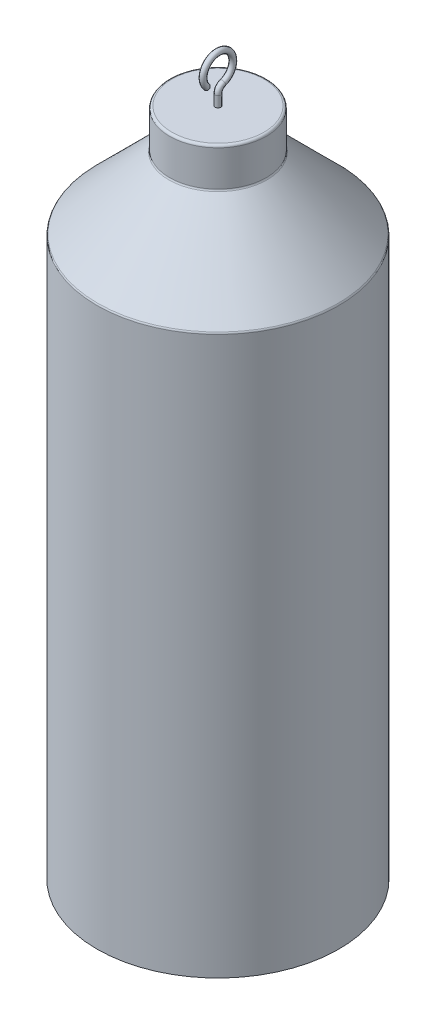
ISO-10303-21;
HEADER;
FILE_DESCRIPTION(('STEP AP214'),'2;1');
FILE_NAME('part.step','',(''),(''),'','','');
FILE_SCHEMA(('AUTOMOTIVE_DESIGN { 1 0 10303 214 1 1 1 1 }'));
ENDSEC;
DATA;
#1=APPLICATION_CONTEXT('core data for automotive mechanical design processes');
#2=APPLICATION_PROTOCOL_DEFINITION('international standard','automotive_design',2000,#1);
#3=PRODUCT_CONTEXT('',#1,'mechanical');
#4=PRODUCT('Part','Part','',(#3));
#5=PRODUCT_RELATED_PRODUCT_CATEGORY('part','',(#4));
#6=PRODUCT_DEFINITION_FORMATION('','',#4);
#7=PRODUCT_DEFINITION_CONTEXT('part definition',#1,'design');
#8=PRODUCT_DEFINITION('design','',#6,#7);
#9=PRODUCT_DEFINITION_SHAPE('','',#8);
#10=(LENGTH_UNIT() NAMED_UNIT(*) SI_UNIT(.MILLI.,.METRE.));
#11=(NAMED_UNIT(*) PLANE_ANGLE_UNIT() SI_UNIT($,.RADIAN.));
#12=(NAMED_UNIT(*) SI_UNIT($,.STERADIAN.) SOLID_ANGLE_UNIT());
#13=UNCERTAINTY_MEASURE_WITH_UNIT(LENGTH_MEASURE(1.E-05),#10,'distance_accuracy_value','');
#14=(GEOMETRIC_REPRESENTATION_CONTEXT(3) GLOBAL_UNCERTAINTY_ASSIGNED_CONTEXT((#13)) GLOBAL_UNIT_ASSIGNED_CONTEXT((#10,
#11,#12)) REPRESENTATION_CONTEXT('',''));
#15=CARTESIAN_POINT('',(0.,0.,0.));
#16=DIRECTION('',(0.,0.,1.));
#17=DIRECTION('',(1.,0.,0.));
#18=AXIS2_PLACEMENT_3D('',#15,#16,#17);
#19=CARTESIAN_POINT('',(0.,188.5,0.));
#20=DIRECTION('',(1.,0.,0.));
#21=DIRECTION('',(0.,0.,-1.));
#22=AXIS2_PLACEMENT_3D('',#19,#20,#21);
#23=TOROIDAL_SURFACE('',#22,4.00000000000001,0.749999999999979);
#24=CARTESIAN_POINT('',(0.,186.359015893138,2.44513538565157));
#25=CARTESIAN_POINT('',(0.401286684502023,186.35914474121,2.4450006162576));
#26=CARTESIAN_POINT('',(0.750067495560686,186.118160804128,2.69824038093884));
#27=CARTESIAN_POINT('',(0.74993206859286,185.562229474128,3.27532288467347));
#28=CARTESIAN_POINT('',(0.402049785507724,185.318174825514,3.52652344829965));
#29=CARTESIAN_POINT('',(-0.402595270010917,185.317864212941,3.52684447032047));
#30=CARTESIAN_POINT('',(-0.750167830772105,185.561850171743,3.27571519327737));
#31=CARTESIAN_POINT('',(-0.749832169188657,186.117738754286,2.69868013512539));
#32=CARTESIAN_POINT('',(-0.401286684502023,186.358887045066,2.44527015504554));
#33=CARTESIAN_POINT('',(0.,186.359015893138,2.44513538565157));
#34=B_SPLINE_CURVE_WITH_KNOTS('',3,(#24,#25,#26,#27,#28,#29,#30,#31,#32,#33),.UNSPECIFIED.,.T.,
.F.,(4,2,2,2,4),(5.26306288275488E-05,0.000844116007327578,0.00163560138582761,
0.00242708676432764,0.00321857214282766),.UNSPECIFIED.);
#35=CARTESIAN_POINT('',(0.,186.359015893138,2.44513538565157));
#36=VERTEX_POINT('',#35);
#37=EDGE_CURVE('E11',#36,#36,#34,.F.);
#38=ORIENTED_EDGE('',*,*,#37,.T.);
#39=EDGE_LOOP('',(#38));
#40=FACE_BOUND('',#39,.T.);
#41=CARTESIAN_POINT('',(0.,184.728763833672,-1.33333333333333));
#42=DIRECTION('',(0.,0.333333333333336,-0.942809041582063));
#43=DIRECTION('',(0.,0.942809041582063,0.333333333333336));
#44=AXIS2_PLACEMENT_3D('',#41,#42,#43);
#45=CIRCLE('',#44,0.749999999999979);
#46=CARTESIAN_POINT('',(0.,185.435870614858,-1.08333333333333));
#47=VERTEX_POINT('',#46);
#48=EDGE_CURVE('E67',#47,#47,#45,.T.);
#49=ORIENTED_EDGE('',*,*,#48,.T.);
#50=EDGE_LOOP('',(#49));
#51=FACE_BOUND('',#50,.T.);
#52=ADVANCED_FACE('F40',(#40,#51),#23,.T.);
#53=CARTESIAN_POINT('',(0.,182.843145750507,-2.));
#54=DIRECTION('',(-1.,0.,0.));
#55=DIRECTION('',(0.,0.,1.));
#56=AXIS2_PLACEMENT_3D('',#53,#54,#55);
#57=TOROIDAL_SURFACE('',#56,2.,0.749999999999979);
#58=CARTESIAN_POINT('',(0.,182.843145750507,0.));
#59=DIRECTION('',(0.,1.,0.));
#60=DIRECTION('',(0.,0.,1.));
#61=AXIS2_PLACEMENT_3D('',#58,#59,#60);
#62=CIRCLE('',#61,0.749999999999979);
#63=CARTESIAN_POINT('',(0.,182.843145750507,0.749999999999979));
#64=VERTEX_POINT('',#63);
#65=EDGE_CURVE('E128',#64,#64,#62,.T.);
#66=CARTESIAN_POINT('',(0.,182.843145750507,-2.));
#67=DIRECTION('',(-1.,0.,0.));
#68=DIRECTION('',(0.,0.,1.));
#69=AXIS2_PLACEMENT_3D('',#66,#67,#68);
#70=CIRCLE('',#69,2.74999999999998);
#71=EDGE_CURVE('',#64,#47,#70,.T.);
#72=ORIENTED_EDGE('',*,*,#65,.T.);
#73=ORIENTED_EDGE('',*,*,#48,.F.);
#74=ORIENTED_EDGE('',*,*,#71,.T.);
#75=ORIENTED_EDGE('',*,*,#71,.F.);
#76=EDGE_LOOP('',(#72,#74,#73,#75));
#77=FACE_BOUND('',#76,.T.);
#78=ADVANCED_FACE('F91',(#77),#57,.T.);
#79=CARTESIAN_POINT('',(0.,182.843145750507,0.));
#80=DIRECTION('',(0.,-1.,0.));
#81=DIRECTION('',(0.,0.,-1.));
#82=AXIS2_PLACEMENT_3D('',#79,#80,#81);
#83=CYLINDRICAL_SURFACE('',#82,0.749999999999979);
#84=CARTESIAN_POINT('',(0.,169.75,0.));
#85=DIRECTION('',(0.,1.,0.));
#86=DIRECTION('',(0.,0.,1.));
#87=AXIS2_PLACEMENT_3D('',#84,#85,#86);
#88=CIRCLE('',#87,0.749999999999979);
#89=CARTESIAN_POINT('',(0.,169.75,0.749999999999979));
#90=VERTEX_POINT('',#89);
#91=EDGE_CURVE('E62',#90,#90,#88,.T.);
#92=ORIENTED_EDGE('',*,*,#91,.T.);
#93=EDGE_LOOP('',(#92));
#94=FACE_BOUND('',#93,.T.);
#95=ORIENTED_EDGE('',*,*,#65,.F.);
#96=EDGE_LOOP('',(#95));
#97=FACE_BOUND('',#96,.T.);
#98=ADVANCED_FACE('F85',(#94,#97),#83,.T.);
#99=CARTESIAN_POINT('',(0.,185.671572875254,2.82842712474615));
#100=DIRECTION('',(0.,-0.707106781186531,-0.707106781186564));
#101=DIRECTION('',(0.,0.707106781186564,-0.707106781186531));
#102=AXIS2_PLACEMENT_3D('',#99,#100,#101);
#103=PLANE('',#102);
#104=CARTESIAN_POINT('',(0.,186.0347394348,2.46526056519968));
#105=CARTESIAN_POINT('',(-0.00842697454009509,186.034737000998,2.46526299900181));
#106=CARTESIAN_POINT('',(-0.0168536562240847,186.034572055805,2.46542794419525));
#107=CARTESIAN_POINT('',(-0.0336251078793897,186.033922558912,2.46607744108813));
#108=CARTESIAN_POINT('',(-0.0419700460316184,186.033440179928,2.46655982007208));
#109=CARTESIAN_POINT('',(-0.0585655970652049,186.032164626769,2.46783537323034));
#110=CARTESIAN_POINT('',(-0.0668164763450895,186.031373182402,2.46862681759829));
#111=CARTESIAN_POINT('',(-0.083211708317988,186.02948875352,2.47051124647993));
#112=CARTESIAN_POINT('',(-0.0913563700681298,186.028397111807,2.47160288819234));
#113=CARTESIAN_POINT('',(-0.107526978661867,186.025921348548,2.47407865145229));
#114=CARTESIAN_POINT('',(-0.11555323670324,186.024538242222,2.47546175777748));
#115=CARTESIAN_POINT('',(-0.13147489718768,186.021488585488,2.47851141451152));
#116=CARTESIAN_POINT('',(-0.139370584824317,186.019822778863,2.48017722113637));
#117=CARTESIAN_POINT('',(-0.155018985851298,186.016216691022,2.48378330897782));
#118=CARTESIAN_POINT('',(-0.162771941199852,186.014276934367,2.48572306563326));
#119=CARTESIAN_POINT('',(-0.178122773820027,186.010131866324,2.48986813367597));
#120=CARTESIAN_POINT('',(-0.185720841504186,186.007926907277,2.49207309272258));
#121=CARTESIAN_POINT('',(-0.200749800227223,186.003260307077,2.49673969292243));
#122=CARTESIAN_POINT('',(-0.208180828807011,186.000798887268,2.49920111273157));
#123=CARTESIAN_POINT('',(-0.222863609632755,185.995628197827,2.50437180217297));
#124=CARTESIAN_POINT('',(-0.230115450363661,185.992919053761,2.50708094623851));
#125=CARTESIAN_POINT('',(-0.24442774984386,185.987261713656,2.51273828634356));
#126=CARTESIAN_POINT('',(-0.25148825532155,185.984313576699,2.51568642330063));
#127=CARTESIAN_POINT('',(-0.265405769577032,185.978187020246,2.5218129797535));
#128=CARTESIAN_POINT('',(-0.272262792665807,185.975008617,2.52499138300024));
#129=CARTESIAN_POINT('',(-0.285761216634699,185.968430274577,2.53156972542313));
#130=CARTESIAN_POINT('',(-0.29240260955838,185.96503032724,2.53496967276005));
#131=CARTESIAN_POINT('',(-0.305457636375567,185.958017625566,2.54198237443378));
#132=CARTESIAN_POINT('',(-0.311871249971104,185.95440485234,2.54559514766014));
#133=CARTESIAN_POINT('',(-0.324458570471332,185.946975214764,2.55302478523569));
#134=CARTESIAN_POINT('',(-0.330632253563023,185.943158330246,2.55684166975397));
#135=CARTESIAN_POINT('',(-0.342727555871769,185.935329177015,2.56467082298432));
#136=CARTESIAN_POINT('',(-0.348649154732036,185.93131689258,2.56868310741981));
#137=CARTESIAN_POINT('',(-0.36022812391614,185.92310564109,2.57689435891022));
#138=CARTESIAN_POINT('',(-0.365885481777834,185.918906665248,2.5810933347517));
#139=CARTESIAN_POINT('',(-0.376923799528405,185.910330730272,2.58966926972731));
#140=CARTESIAN_POINT('',(-0.382304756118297,185.905953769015,2.59404623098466));
#141=CARTESIAN_POINT('',(-0.392778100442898,185.897030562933,2.60296943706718));
#142=CARTESIAN_POINT('',(-0.397870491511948,185.892484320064,2.6075156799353));
#143=CARTESIAN_POINT('',(-0.407754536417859,185.883231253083,2.61676874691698));
#144=CARTESIAN_POINT('',(-0.412546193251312,185.87852443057,2.62147556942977));
#145=CARTESIAN_POINT('',(-0.421816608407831,185.868958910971,2.63104108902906));
#146=CARTESIAN_POINT('',(-0.426295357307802,185.864100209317,2.63589979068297));
#147=CARTESIAN_POINT('',(-0.434927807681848,185.854239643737,2.64576035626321));
#148=CARTESIAN_POINT('',(-0.439081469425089,185.849237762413,2.65076223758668));
#149=CARTESIAN_POINT('',(-0.447051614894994,185.839099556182,2.66090044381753));
#150=CARTESIAN_POINT('',(-0.450868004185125,185.833963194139,2.66603680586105));
#151=CARTESIAN_POINT('',(-0.458151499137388,185.823564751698,2.67643524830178));
#152=CARTESIAN_POINT('',(-0.461618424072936,185.818302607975,2.68169739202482));
#153=CARTESIAN_POINT('',(-0.468190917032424,185.807661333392,2.69233866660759));
#154=CARTESIAN_POINT('',(-0.471296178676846,185.80228210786,2.69771789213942));
#155=CARTESIAN_POINT('',(-0.477133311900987,185.791415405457,2.708584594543));
#156=CARTESIAN_POINT('',(-0.479864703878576,185.785927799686,2.71407220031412));
#157=CARTESIAN_POINT('',(-0.484942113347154,185.77485307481,2.72514692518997));
#158=CARTESIAN_POINT('',(-0.487287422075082,185.769265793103,2.73073420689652));
#159=CARTESIAN_POINT('',(-0.491580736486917,185.758000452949,2.74199954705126));
#160=CARTESIAN_POINT('',(-0.493527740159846,185.752322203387,2.74767779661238));
#161=CARTESIAN_POINT('',(-0.497012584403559,185.740883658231,2.75911634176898));
#162=CARTESIAN_POINT('',(-0.498549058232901,185.735123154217,2.76487684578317));
#163=CARTESIAN_POINT('',(-0.501201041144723,185.723528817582,2.77647118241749));
#164=CARTESIAN_POINT('',(-0.502314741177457,185.717694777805,2.78230522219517));
#165=CARTESIAN_POINT('',(-0.504109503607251,185.705962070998,2.79403792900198));
#166=CARTESIAN_POINT('',(-0.504788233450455,185.700063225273,2.7999367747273));
#167=CARTESIAN_POINT('',(-0.505701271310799,185.688209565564,2.81179043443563));
#168=CARTESIAN_POINT('',(-0.505932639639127,185.682254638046,2.817745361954));
#169=CARTESIAN_POINT('',(-0.505939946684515,185.670344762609,2.82965523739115));
#170=CARTESIAN_POINT('',(-0.505715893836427,185.664389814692,2.83561018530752));
#171=CARTESIAN_POINT('',(-0.50481844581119,185.652536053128,2.84746394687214));
#172=CARTESIAN_POINT('',(-0.504148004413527,185.646637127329,2.85336287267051));
#173=CARTESIAN_POINT('',(-0.502370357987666,185.634904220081,2.86509577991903));
#174=CARTESIAN_POINT('',(-0.501265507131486,185.629070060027,2.87092993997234));
#175=CARTESIAN_POINT('',(-0.498631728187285,185.617475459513,2.88252454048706));
#176=CARTESIAN_POINT('',(-0.49710463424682,185.611714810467,2.88828518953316));
#177=CARTESIAN_POINT('',(-0.493638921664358,185.6002759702,2.89972402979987));
#178=CARTESIAN_POINT('',(-0.491701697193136,185.594597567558,2.90540243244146));
#179=CARTESIAN_POINT('',(-0.487428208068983,185.583331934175,2.91666806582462));
#180=CARTESIAN_POINT('',(-0.485092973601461,185.577744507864,2.92225549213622));
#181=CARTESIAN_POINT('',(-0.480035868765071,185.566669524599,2.93333047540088));
#182=CARTESIAN_POINT('',(-0.47731473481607,185.561181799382,2.93881820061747));
#183=CARTESIAN_POINT('',(-0.47149816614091,185.550314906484,2.94968509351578));
#184=CARTESIAN_POINT('',(-0.468403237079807,185.544935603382,2.95506439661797));
#185=CARTESIAN_POINT('',(-0.461851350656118,185.534294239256,2.9657057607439));
#186=CARTESIAN_POINT('',(-0.458394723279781,185.529032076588,2.97096792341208));
#187=CARTESIAN_POINT('',(-0.451131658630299,185.51863367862,2.98136632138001));
#188=CARTESIAN_POINT('',(-0.447325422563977,185.513497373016,2.98650262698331));
#189=CARTESIAN_POINT('',(-0.439375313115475,185.50335937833,2.99664062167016));
#190=CARTESIAN_POINT('',(-0.435231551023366,185.498357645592,3.00164235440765));
#191=CARTESIAN_POINT('',(-0.426618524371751,185.488497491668,3.01150250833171));
#192=CARTESIAN_POINT('',(-0.422149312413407,185.4836390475,3.01636095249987));
#193=CARTESIAN_POINT('',(-0.412897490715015,185.474074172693,3.02592582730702));
#194=CARTESIAN_POINT('',(-0.408114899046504,185.469367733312,3.03063226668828));
#195=CARTESIAN_POINT('',(-0.398248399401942,185.460115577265,3.03988442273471));
#196=CARTESIAN_POINT('',(-0.393164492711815,185.455569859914,3.04443014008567));
#197=CARTESIAN_POINT('',(-0.382707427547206,185.446647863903,3.05335213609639));
#198=CARTESIAN_POINT('',(-0.377334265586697,185.442271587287,3.05772841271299));
#199=CARTESIAN_POINT('',(-0.366310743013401,185.433697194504,3.06630280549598));
#200=CARTESIAN_POINT('',(-0.360660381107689,185.429499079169,3.07050092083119));
#201=CARTESIAN_POINT('',(-0.34909450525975,185.421289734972,3.07871026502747));
#202=CARTESIAN_POINT('',(-0.343178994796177,185.417278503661,3.08272149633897));
#203=CARTESIAN_POINT('',(-0.331094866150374,185.409451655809,3.09054834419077));
#204=CARTESIAN_POINT('',(-0.324926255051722,185.405636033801,3.09436396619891));
#205=CARTESIAN_POINT('',(-0.312347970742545,185.398209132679,3.10179086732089));
#206=CARTESIAN_POINT('',(-0.305938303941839,185.394597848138,3.10540215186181));
#207=CARTESIAN_POINT('',(-0.29288995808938,185.387588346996,3.11241165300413));
#208=CARTESIAN_POINT('',(-0.286251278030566,185.384190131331,3.11580986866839));
#209=CARTESIAN_POINT('',(-0.272756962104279,185.377615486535,3.12238451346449));
#210=CARTESIAN_POINT('',(-0.265901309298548,185.374439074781,3.12556092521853));
#211=CARTESIAN_POINT('',(-0.251985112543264,185.368316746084,3.13168325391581));
#212=CARTESIAN_POINT('',(-0.244924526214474,185.365370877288,3.13462912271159));
#213=CARTESIAN_POINT('',(-0.230610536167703,185.35971832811,3.14028167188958));
#214=CARTESIAN_POINT('',(-0.223357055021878,185.357011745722,3.14298825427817));
#215=CARTESIAN_POINT('',(-0.208669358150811,185.351846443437,3.14815355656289));
#216=CARTESIAN_POINT('',(-0.20123502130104,185.349387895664,3.1506121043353));
#217=CARTESIAN_POINT('',(-0.186197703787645,185.344727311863,3.15527268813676));
#218=CARTESIAN_POINT('',(-0.178594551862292,185.342525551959,3.15747444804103));
#219=CARTESIAN_POINT('',(-0.163231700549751,185.338387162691,3.16161283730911));
#220=CARTESIAN_POINT('',(-0.155471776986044,185.336450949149,3.16354905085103));
#221=CARTESIAN_POINT('',(-0.13980748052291,185.332852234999,3.16714776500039));
#222=CARTESIAN_POINT('',(-0.131902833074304,185.331190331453,3.16880966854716));
#223=CARTESIAN_POINT('',(-0.115961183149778,185.328148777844,3.17185122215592));
#224=CARTESIAN_POINT('',(-0.107923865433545,185.326769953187,3.17323004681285));
#225=CARTESIAN_POINT('',(-0.0917289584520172,185.324303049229,3.17569695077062));
#226=CARTESIAN_POINT('',(-0.0835710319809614,185.323216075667,3.17678392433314));
#227=CARTESIAN_POINT('',(-0.0671469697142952,185.321341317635,3.17865868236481));
#228=CARTESIAN_POINT('',(-0.0588805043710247,185.320554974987,3.17944502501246));
#229=CARTESIAN_POINT('',(-0.0422513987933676,185.319289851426,3.18071014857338));
#230=CARTESIAN_POINT('',(-0.0338884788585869,185.318812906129,3.18118709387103));
#231=CARTESIAN_POINT('',(-0.0170784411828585,185.318174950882,3.18182504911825));
#232=CARTESIAN_POINT('',(-0.0086311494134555,185.318016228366,3.18198377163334));
#233=CARTESIAN_POINT('',(0.00826362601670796,185.318022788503,3.18197721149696));
#234=CARTESIAN_POINT('',(0.0167111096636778,185.318188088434,3.18181191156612));
#235=CARTESIAN_POINT('',(0.0335219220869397,185.318838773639,3.1811612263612));
#236=CARTESIAN_POINT('',(0.0418854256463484,185.319321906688,3.18067809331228));
#237=CARTESIAN_POINT('',(0.0585160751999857,185.320599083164,3.17940091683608));
#238=CARTESIAN_POINT('',(0.0667834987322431,185.32139132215,3.17860867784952));
#239=CARTESIAN_POINT('',(0.08320984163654,185.323277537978,3.17672246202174));
#240=CARTESIAN_POINT('',(0.0913690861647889,185.324370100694,3.1756298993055));
#241=CARTESIAN_POINT('',(0.10756697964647,185.326847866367,3.17315213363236));
#242=CARTESIAN_POINT('',(0.115605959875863,185.328231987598,3.17176801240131));
#243=CARTESIAN_POINT('',(0.131551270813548,185.331283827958,3.16871617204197));
#244=CARTESIAN_POINT('',(0.139457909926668,185.332950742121,3.16704925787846));
#245=CARTESIAN_POINT('',(0.155126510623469,185.33655918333,3.16344081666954));
#246=CARTESIAN_POINT('',(0.16288873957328,185.338500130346,3.16149986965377));
#247=CARTESIAN_POINT('',(0.178256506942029,185.342647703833,3.157352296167));
#248=CARTESIAN_POINT('',(0.185862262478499,185.34485392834,3.15514607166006));
#249=CARTESIAN_POINT('',(0.200905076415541,185.349523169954,3.15047683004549));
#250=CARTESIAN_POINT('',(0.208342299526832,185.351985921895,3.14801407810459));
#251=CARTESIAN_POINT('',(0.223036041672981,185.357159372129,3.14284062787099));
#252=CARTESIAN_POINT('',(0.23029267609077,185.359869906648,3.14013009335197));
#253=CARTESIAN_POINT('',(0.244613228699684,185.365530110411,3.1344698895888));
#254=CARTESIAN_POINT('',(0.251677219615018,185.368479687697,3.13152031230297));
#255=CARTESIAN_POINT('',(0.265600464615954,185.37460919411,3.12539080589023));
#256=CARTESIAN_POINT('',(0.272459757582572,185.377789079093,3.12221092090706));
#257=CARTESIAN_POINT('',(0.285961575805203,185.38437044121,3.11562955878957));
#258=CARTESIAN_POINT('',(0.292604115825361,185.387771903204,3.11222809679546));
#259=CARTESIAN_POINT('',(0.305660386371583,185.394787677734,3.10521232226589));
#260=CARTESIAN_POINT('',(0.312074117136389,185.398401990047,3.10159800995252));
#261=CARTESIAN_POINT('',(0.324660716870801,185.405834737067,3.09416526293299));
#262=CARTESIAN_POINT('',(0.330833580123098,185.409653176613,3.09034682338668));
#263=CARTESIAN_POINT('',(0.342926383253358,185.417485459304,3.08251454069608));
#264=CARTESIAN_POINT('',(0.348846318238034,185.421499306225,3.07850069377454));
#265=CARTESIAN_POINT('',(0.360421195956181,185.429713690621,3.07028630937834));
#266=CARTESIAN_POINT('',(0.366076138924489,185.433914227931,3.06608577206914));
#267=CARTESIAN_POINT('',(0.377108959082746,185.442493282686,3.05750671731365));
#268=CARTESIAN_POINT('',(0.382486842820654,185.446871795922,3.05312820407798));
#269=CARTESIAN_POINT('',(0.392953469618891,185.455798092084,3.04420190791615));
#270=CARTESIAN_POINT('',(0.398042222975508,185.460345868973,3.03965413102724));
#271=CARTESIAN_POINT('',(0.407918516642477,185.469601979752,3.03039802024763));
#272=CARTESIAN_POINT('',(0.41270606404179,185.47431030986,3.02568969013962));
#273=CARTESIAN_POINT('',(0.421967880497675,185.483878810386,3.01612118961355));
#274=CARTESIAN_POINT('',(0.42644214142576,185.488738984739,3.01126101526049));
#275=CARTESIAN_POINT('',(0.435065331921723,185.498602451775,3.00139754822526));
#276=CARTESIAN_POINT('',(0.439214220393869,185.503605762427,2.99639423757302));
#277=CARTESIAN_POINT('',(0.447174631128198,185.513746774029,2.98625322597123));
#278=CARTESIAN_POINT('',(0.450986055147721,185.518884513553,2.98111548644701));
#279=CARTESIAN_POINT('',(0.458259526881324,185.529285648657,2.97071435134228));
#280=CARTESIAN_POINT('',(0.461721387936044,185.534549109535,2.96545089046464));
#281=CARTESIAN_POINT('',(0.468283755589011,185.545192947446,2.95480705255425));
#282=CARTESIAN_POINT('',(0.471383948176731,185.550573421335,2.94942657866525));
#283=CARTESIAN_POINT('',(0.477211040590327,185.561442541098,2.93855745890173));
#284=CARTESIAN_POINT('',(0.479937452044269,185.566931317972,2.93306868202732));
#285=CARTESIAN_POINT('',(0.485005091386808,185.578008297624,2.92199170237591));
#286=CARTESIAN_POINT('',(0.48734560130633,185.583596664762,2.91640333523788));
#287=CARTESIAN_POINT('',(0.491629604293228,185.594864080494,2.90513591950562));
#288=CARTESIAN_POINT('',(0.49357208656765,185.60054332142,2.89945667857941));
#289=CARTESIAN_POINT('',(0.497048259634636,185.611983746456,2.88801625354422));
#290=CARTESIAN_POINT('',(0.498580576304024,185.617745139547,2.88225486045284));
#291=CARTESIAN_POINT('',(0.501224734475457,185.629341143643,2.87065885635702));
#292=CARTESIAN_POINT('',(0.502334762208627,185.635175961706,2.86482403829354));
#293=CARTESIAN_POINT('',(0.504122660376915,185.646910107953,2.85308989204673));
#294=CARTESIAN_POINT('',(0.504798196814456,185.65280961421,2.84719038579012));
#295=CARTESIAN_POINT('',(0.50570579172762,185.66466446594,2.83533553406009));
#296=CARTESIAN_POINT('',(0.505934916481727,185.670619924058,2.82938007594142));
#297=CARTESIAN_POINT('',(0.505937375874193,185.682530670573,2.817469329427));
#298=CARTESIAN_POINT('',(0.505710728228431,185.688485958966,2.81151404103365));
#299=CARTESIAN_POINT('',(0.504806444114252,185.700340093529,2.79965990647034));
#300=CARTESIAN_POINT('',(0.504131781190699,185.706239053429,2.79376094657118));
#301=CARTESIAN_POINT('',(0.502344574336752,185.717971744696,2.78202825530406));
#302=CARTESIAN_POINT('',(0.501234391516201,185.723805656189,2.77619434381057));
#303=CARTESIAN_POINT('',(0.498588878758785,185.73539949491,2.76460050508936));
#304=CARTESIAN_POINT('',(0.497055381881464,185.741159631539,2.7588403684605));
#305=CARTESIAN_POINT('',(0.49357596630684,185.752597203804,2.74740279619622));
#306=CARTESIAN_POINT('',(0.491631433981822,185.75827485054,2.74172514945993));
#307=CARTESIAN_POINT('',(0.487342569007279,185.76953875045,2.73046124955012));
#308=CARTESIAN_POINT('',(0.484999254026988,185.775125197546,2.72487480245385));
#309=CARTESIAN_POINT('',(0.479925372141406,185.786198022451,2.71380197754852));
#310=CARTESIAN_POINT('',(0.477195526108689,185.791684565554,2.70831543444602));
#311=CARTESIAN_POINT('',(0.471361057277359,185.802548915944,2.69745108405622));
#312=CARTESIAN_POINT('',(0.468256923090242,185.80792685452,2.69207314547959));
#313=CARTESIAN_POINT('',(0.461686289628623,185.81856533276,2.68143466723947));
#314=CARTESIAN_POINT('',(0.458220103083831,185.823825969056,2.67617403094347));
#315=CARTESIAN_POINT('',(0.450937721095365,185.834221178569,2.66577882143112));
#316=CARTESIAN_POINT('',(0.447121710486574,185.839355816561,2.66064418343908));
#317=CARTESIAN_POINT('',(0.439151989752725,185.849490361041,2.65050963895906));
#318=CARTESIAN_POINT('',(0.434998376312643,185.854490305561,2.64550969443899));
#319=CARTESIAN_POINT('',(0.426365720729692,185.864346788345,2.63565321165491));
#320=CARTESIAN_POINT('',(0.421886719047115,185.869203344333,2.63079665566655));
#321=CARTESIAN_POINT('',(0.412615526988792,185.878764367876,2.62123563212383));
#322=CARTESIAN_POINT('',(0.407823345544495,185.883468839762,2.61653116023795));
#323=CARTESIAN_POINT('',(0.397938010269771,185.892717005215,2.60728299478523));
#324=CARTESIAN_POINT('',(0.392844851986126,185.897260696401,2.60273930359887));
#325=CARTESIAN_POINT('',(0.38236976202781,185.906178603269,2.59382139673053));
#326=CARTESIAN_POINT('',(0.376987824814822,185.910552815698,2.58944718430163));
#327=CARTESIAN_POINT('',(0.36594736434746,185.919123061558,2.58087693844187));
#328=CARTESIAN_POINT('',(0.360288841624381,185.923319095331,2.57668090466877));
#329=CARTESIAN_POINT('',(0.348707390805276,185.931524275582,2.56847572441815));
#330=CARTESIAN_POINT('',(0.342784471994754,185.935533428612,2.56446657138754));
#331=CARTESIAN_POINT('',(0.330686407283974,185.94335613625,2.55664386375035));
#332=CARTESIAN_POINT('',(0.324511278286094,185.947169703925,2.55283029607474));
#333=CARTESIAN_POINT('',(0.311920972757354,185.954592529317,2.54540747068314));
#334=CARTESIAN_POINT('',(0.305505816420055,185.958201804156,2.54179819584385));
#335=CARTESIAN_POINT('',(0.292447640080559,185.965207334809,2.53479266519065));
#336=CARTESIAN_POINT('',(0.285804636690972,185.968603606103,2.53139639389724));
#337=CARTESIAN_POINT('',(0.272302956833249,185.975174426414,2.52482557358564));
#338=CARTESIAN_POINT('',(0.265444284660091,185.978348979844,2.52165102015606));
#339=CARTESIAN_POINT('',(0.251523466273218,185.984467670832,2.51553232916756));
#340=CARTESIAN_POINT('',(0.244461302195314,185.987411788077,2.51258821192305));
#341=CARTESIAN_POINT('',(0.230145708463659,185.993060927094,2.50693907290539));
#342=CARTESIAN_POINT('',(0.222892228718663,185.995765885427,2.50423411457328));
#343=CARTESIAN_POINT('',(0.208206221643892,186.000928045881,2.49907195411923));
#344=CARTESIAN_POINT('',(0.200773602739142,186.003385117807,2.49661488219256));
#345=CARTESIAN_POINT('',(0.185741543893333,186.008042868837,2.49195713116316));
#346=CARTESIAN_POINT('',(0.178141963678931,186.010243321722,2.48975667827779));
#347=CARTESIAN_POINT('',(0.162788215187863,186.014379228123,2.48562077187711));
#348=CARTESIAN_POINT('',(0.155033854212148,186.016314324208,2.48368567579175));
#349=CARTESIAN_POINT('',(0.139382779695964,186.019910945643,2.48008905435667));
#350=CARTESIAN_POINT('',(0.131485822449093,186.02157194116,2.47842805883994));
#351=CARTESIAN_POINT('',(0.115561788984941,186.024611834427,2.4753881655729));
#352=CARTESIAN_POINT('',(0.10753442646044,186.025989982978,2.47401001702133));
#353=CARTESIAN_POINT('',(0.0913618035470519,186.028455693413,2.47154430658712));
#354=CARTESIAN_POINT('',(0.083216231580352,186.029542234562,2.47045776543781));
#355=CARTESIAN_POINT('',(0.0668194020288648,186.031416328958,2.46858367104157));
#356=CARTESIAN_POINT('',(0.058567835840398,186.032202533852,2.46779746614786));
#357=CARTESIAN_POINT('',(0.0419711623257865,186.033467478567,2.46653252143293));
#358=CARTESIAN_POINT('',(0.0336257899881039,186.033944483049,2.46605551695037));
#359=CARTESIAN_POINT('',(0.0168537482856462,186.03458310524,2.46541689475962));
#360=CARTESIAN_POINT('',(0.00842691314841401,186.034742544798,2.46525745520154));
#361=CARTESIAN_POINT('',(0.,186.0347394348,2.46526056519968));
#362=B_SPLINE_CURVE_WITH_KNOTS('',3,(#104,#105,#106,#107,#108,#109,#110,#111,#112,#113,#114,
#115,#116,#117,#118,#119,#120,#121,#122,#123,#124,#125,#126,#127,#128,#129,#130,#131,#132,#133,
#134,#135,#136,#137,#138,#139,#140,#141,#142,#143,#144,#145,#146,#147,#148,#149,#150,#151,#152,
#153,#154,#155,#156,#157,#158,#159,#160,#161,#162,#163,#164,#165,#166,#167,#168,#169,#170,#171,
#172,#173,#174,#175,#176,#177,#178,#179,#180,#181,#182,#183,#184,#185,#186,#187,#188,#189,#190,
#191,#192,#193,#194,#195,#196,#197,#198,#199,#200,#201,#202,#203,#204,#205,#206,#207,#208,#209,
#210,#211,#212,#213,#214,#215,#216,#217,#218,#219,#220,#221,#222,#223,#224,#225,#226,#227,#228,
#229,#230,#231,#232,#233,#234,#235,#236,#237,#238,#239,#240,#241,#242,#243,#244,#245,#246,#247,
#248,#249,#250,#251,#252,#253,#254,#255,#256,#257,#258,#259,#260,#261,#262,#263,#264,#265,#266,
#267,#268,#269,#270,#271,#272,#273,#274,#275,#276,#277,#278,#279,#280,#281,#282,#283,#284,#285,
#286,#287,#288,#289,#290,#291,#292,#293,#294,#295,#296,#297,#298,#299,#300,#301,#302,#303,#304,
#305,#306,#307,#308,#309,#310,#311,#312,#313,#314,#315,#316,#317,#318,#319,#320,#321,#322,#323,
#324,#325,#326,#327,#328,#329,#330,#331,#332,#333,#334,#335,#336,#337,#338,#339,#340,#341,#342,
#343,#344,#345,#346,#347,#348,#349,#350,#351,#352,#353,#354,#355,#356,#357,#358,#359,#360,#361),
.UNSPECIFIED.,.F.,.F.,(4,2,2,2,2,2,2,2,2,2,2,2,2,2,2,2,2,2,2,2,2,2,2,2,2,2,2,2,2,2,2,2,2,2,2,2,
2,2,2,2,2,2,2,2,2,2,2,2,2,2,2,2,2,2,2,2,2,2,2,2,2,2,2,2,2,2,2,2,2,2,2,2,2,2,2,2,2,2,2,2,2,2,2,2,
2,2,2,2,2,2,2,2,2,2,2,2,2,2,2,2,2,2,2,2,2,2,2,2,2,2,2,2,2,2,2,2,2,2,2,2,2,2,2,2,2,2,2,2,4),(0.,
0.0252775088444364,0.0503837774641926,0.0753514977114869,0.100209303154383,0.124981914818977,
0.149690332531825,0.174352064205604,0.198981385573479,0.223589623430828,0.248185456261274,
0.272775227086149,0.297363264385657,0.321952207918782,0.346543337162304,0.371136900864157,
0.395732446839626,0.420329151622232,0.444926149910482,0.469522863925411,0.494119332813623,
0.518716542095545,0.543316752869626,0.567923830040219,0.592543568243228,0.617184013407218,
0.641855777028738,0.666572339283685,0.691350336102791,0.71620982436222,0.741174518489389,
0.766271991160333,0.791533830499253,0.816795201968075,0.841891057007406,0.866852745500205,
0.891707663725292,0.916479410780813,0.941187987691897,0.965850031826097,0.990479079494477,
1.0150858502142,1.03967854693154,1.0642631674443,1.0888438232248,1.11342306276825,
1.13800219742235,1.16258162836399,1.18716117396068,1.21174039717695,1.23631893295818,
1.2608968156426,1.28547480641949,1.31005472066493,1.33463975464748,1.35923481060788,
1.38384681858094,1.40848505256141,1.43316143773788,1.45789084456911,1.48269136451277,
1.50758456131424,1.53259569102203,1.5577538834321,1.58309227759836,1.60843202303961,
1.63359411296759,1.65861146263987,1.68351297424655,1.7083236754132,1.73306490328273,
1.75775452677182,1.78240719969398,1.80703463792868,1.83164591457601,1.85624776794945,
1.88084491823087,1.90544038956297,1.93003583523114,1.95463186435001,1.97922836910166,
2.00382485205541,2.02842075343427,2.05301577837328,2.07761022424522,2.10220530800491,
2.12680349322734,2.15140881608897,2.17602720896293,2.20066681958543,2.22533832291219,
2.25005522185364,2.27483413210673,2.29969504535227,2.32466156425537,2.34976110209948,
2.37502503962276,2.40028799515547,2.42538493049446,2.45034764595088,2.47520391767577,
2.499977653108,2.52468909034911,2.54935503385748,2.57398911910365,2.59860209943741,
2.6232021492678,2.64779517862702,2.67238515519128,2.6969744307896,2.72156407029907,
2.74615418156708,2.7707442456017,2.7953334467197,2.8199210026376,2.84450649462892,
2.86909019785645,2.89367341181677,2.91825879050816,2.94285067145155,2.96745540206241,
2.99208166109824,3.01674077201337,3.04144700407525,3.06621785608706,3.09107431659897,
3.11604109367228,3.14114680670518,3.16642413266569),.UNSPECIFIED.);
#363=CARTESIAN_POINT('',(0.,186.0347394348,2.46526056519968));
#364=VERTEX_POINT('',#363);
#365=EDGE_CURVE('E52',#364,#364,#362,.F.);
#366=ORIENTED_EDGE('',*,*,#365,.T.);
#367=EDGE_LOOP('',(#366));
#368=FACE_BOUND('',#367,.T.);
#369=ADVANCED_FACE('F75',(#368),#103,.T.);
#370=CARTESIAN_POINT('',(0.,169.5,0.));
#371=DIRECTION('',(0.,1.,0.));
#372=DIRECTION('',(0.,0.,1.));
#373=AXIS2_PLACEMENT_3D('',#370,#371,#372);
#374=PLANE('',#373);
#375=CARTESIAN_POINT('',(0.,169.5,0.));
#376=DIRECTION('',(0.,1.,0.));
#377=DIRECTION('',(0.,0.,1.));
#378=AXIS2_PLACEMENT_3D('',#375,#376,#377);
#379=CIRCLE('',#378,0.499999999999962);
#380=CARTESIAN_POINT('',(0.,169.5,0.499999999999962));
#381=VERTEX_POINT('',#380);
#382=EDGE_CURVE('E57',#381,#381,#379,.F.);
#383=ORIENTED_EDGE('',*,*,#382,.T.);
#384=EDGE_LOOP('',(#383));
#385=FACE_BOUND('',#384,.T.);
#386=ADVANCED_FACE('F84',(#385),#374,.F.);
#387=CARTESIAN_POINT('',(0.,169.75,0.));
#388=DIRECTION('',(0.,1.,0.));
#389=DIRECTION('',(0.,0.,1.));
#390=AXIS2_PLACEMENT_3D('',#387,#388,#389);
#391=CONICAL_SURFACE('',#390,0.749999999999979,0.785398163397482);
#392=ORIENTED_EDGE('',*,*,#382,.F.);
#393=EDGE_LOOP('',(#392));
#394=FACE_BOUND('',#393,.T.);
#395=ORIENTED_EDGE('',*,*,#91,.F.);
#396=EDGE_LOOP('',(#395));
#397=FACE_BOUND('',#396,.T.);
#398=ADVANCED_FACE('F88',(#394,#397),#391,.T.);
#399=CARTESIAN_POINT('',(0.,186.0347394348,2.46526056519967));
#400=CARTESIAN_POINT('',(0.270700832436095,186.034828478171,2.46517152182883));
#401=CARTESIAN_POINT('',(0.505981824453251,185.867857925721,2.63214207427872));
#402=CARTESIAN_POINT('',(0.505890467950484,185.485292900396,3.01470709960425));
#403=CARTESIAN_POINT('',(0.271215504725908,185.318126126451,3.1818738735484));
#404=CARTESIAN_POINT('',(-0.271583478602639,185.317912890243,3.18208710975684));
#405=CARTESIAN_POINT('',(-0.506049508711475,185.485032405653,3.01496759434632));
#406=CARTESIAN_POINT('',(-0.50582307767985,185.86756688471,2.63243311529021));
#407=CARTESIAN_POINT('',(-0.270700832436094,186.034650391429,2.46534960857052));
#408=CARTESIAN_POINT('',(0.,186.0347394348,2.46526056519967));
#409=CARTESIAN_POINT('',(0.,186.359015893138,2.44513538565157));
#410=CARTESIAN_POINT('',(0.401286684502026,186.35914474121,2.4450006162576));
#411=CARTESIAN_POINT('',(0.750067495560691,186.118160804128,2.69824038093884));
#412=CARTESIAN_POINT('',(0.749932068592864,185.562229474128,3.27532288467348));
#413=CARTESIAN_POINT('',(0.402049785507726,185.318174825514,3.52652344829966));
#414=CARTESIAN_POINT('',(-0.402595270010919,185.317864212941,3.52684447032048));
#415=CARTESIAN_POINT('',(-0.75016783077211,185.561850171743,3.27571519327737));
#416=CARTESIAN_POINT('',(-0.749832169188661,186.117738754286,2.69868013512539));
#417=CARTESIAN_POINT('',(-0.401286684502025,186.358887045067,2.44527015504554));
#418=CARTESIAN_POINT('',(0.,186.359015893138,2.44513538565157));
#419=B_SPLINE_SURFACE_WITH_KNOTS('',1,3,((#399,#400,#401,#402,#403,#404,#405,#406,#407,#408),
(#409,#410,#411,#412,#413,#414,#415,#416,#417,#418)),.UNSPECIFIED.,.F.,.T.,.F.,(2,2),(4,2,2,2,
4),(0.,1.),(5.26306288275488E-05,0.000844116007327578,0.00163560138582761,0.00242708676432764,
0.00321857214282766),.UNSPECIFIED.);
#420=ORIENTED_EDGE('',*,*,#37,.F.);
#421=EDGE_LOOP('',(#420));
#422=FACE_BOUND('',#421,.T.);
#423=ORIENTED_EDGE('',*,*,#365,.F.);
#424=EDGE_LOOP('',(#423));
#425=FACE_BOUND('',#424,.T.);
#426=ADVANCED_FACE('F42',(#422,#425),#419,.T.);
#427=CLOSED_SHELL('',(#52,#78,#98,#369,#386,#398,#426));
#428=MANIFOLD_SOLID_BREP('B2',#427);
#429=CARTESIAN_POINT('',(0.,0.,0.));
#430=DIRECTION('',(0.,1.,0.));
#431=DIRECTION('',(0.,0.,1.));
#432=AXIS2_PLACEMENT_3D('',#429,#430,#431);
#433=PLANE('',#432);
#434=CARTESIAN_POINT('',(0.,0.,0.));
#435=DIRECTION('',(0.,1.,0.));
#436=DIRECTION('',(0.,0.,1.));
#437=AXIS2_PLACEMENT_3D('',#434,#435,#436);
#438=CIRCLE('',#437,32.5);
#439=CARTESIAN_POINT('',(0.,0.,32.5));
#440=VERTEX_POINT('',#439);
#441=EDGE_CURVE('E39',#440,#440,#438,.T.);
#442=ORIENTED_EDGE('',*,*,#441,.F.);
#443=EDGE_LOOP('',(#442));
#444=FACE_BOUND('',#443,.T.);
#445=ADVANCED_FACE('F185',(#444),#433,.F.);
#446=CARTESIAN_POINT('',(0.,169.5,0.));
#447=DIRECTION('',(0.,1.,0.));
#448=DIRECTION('',(0.,0.,1.));
#449=AXIS2_PLACEMENT_3D('',#446,#447,#448);
#450=CYLINDRICAL_SURFACE('',#449,32.5);
#451=CARTESIAN_POINT('',(0.,149.736974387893,0.));
#452=DIRECTION('',(0.,1.,0.));
#453=DIRECTION('',(0.,0.,1.));
#454=AXIS2_PLACEMENT_3D('',#451,#452,#453);
#455=CIRCLE('',#454,32.5);
#456=CARTESIAN_POINT('',(0.,149.736974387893,32.5));
#457=VERTEX_POINT('',#456);
#458=EDGE_CURVE('E191',#457,#457,#455,.T.);
#459=ORIENTED_EDGE('',*,*,#458,.F.);
#460=EDGE_LOOP('',(#459));
#461=FACE_BOUND('',#460,.T.);
#462=ORIENTED_EDGE('',*,*,#441,.T.);
#463=EDGE_LOOP('',(#462));
#464=FACE_BOUND('',#463,.T.);
#465=ADVANCED_FACE('F260',(#461,#464),#450,.T.);
#466=CARTESIAN_POINT('',(0.,149.736974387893,0.));
#467=DIRECTION('',(0.,1.,0.));
#468=DIRECTION('',(0.,0.,1.));
#469=AXIS2_PLACEMENT_3D('',#466,#467,#468);
#470=TOROIDAL_SURFACE('',#469,31.865,0.635000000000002);
#471=CARTESIAN_POINT('',(0.,150.185987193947,0.));
#472=DIRECTION('',(0.,1.,0.));
#473=DIRECTION('',(0.,0.,1.));
#474=AXIS2_PLACEMENT_3D('',#471,#472,#473);
#475=CIRCLE('',#474,32.3140128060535);
#476=CARTESIAN_POINT('',(0.,150.185987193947,32.3140128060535));
#477=VERTEX_POINT('',#476);
#478=EDGE_CURVE('E195',#477,#477,#475,.T.);
#479=ORIENTED_EDGE('',*,*,#478,.F.);
#480=EDGE_LOOP('',(#479));
#481=FACE_BOUND('',#480,.T.);
#482=ORIENTED_EDGE('',*,*,#458,.T.);
#483=EDGE_LOOP('',(#482));
#484=FACE_BOUND('',#483,.T.);
#485=ADVANCED_FACE('F255',(#481,#484),#470,.T.);
#486=CARTESIAN_POINT('',(0.,150.185987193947,0.));
#487=DIRECTION('',(0.,-1.,0.));
#488=DIRECTION('',(0.,0.,-1.));
#489=AXIS2_PLACEMENT_3D('',#486,#487,#488);
#490=CONICAL_SURFACE('',#489,32.3140128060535,0.78539816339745);
#491=CARTESIAN_POINT('',(0.,169.314012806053,0.));
#492=DIRECTION('',(0.,1.,0.));
#493=DIRECTION('',(0.,0.,1.));
#494=AXIS2_PLACEMENT_3D('',#491,#492,#493);
#495=CIRCLE('',#494,13.1859871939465);
#496=CARTESIAN_POINT('',(0.,169.314012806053,13.1859871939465));
#497=VERTEX_POINT('',#496);
#498=EDGE_CURVE('E199',#497,#497,#495,.T.);
#499=ORIENTED_EDGE('',*,*,#498,.F.);
#500=EDGE_LOOP('',(#499));
#501=FACE_BOUND('',#500,.T.);
#502=ORIENTED_EDGE('',*,*,#478,.T.);
#503=EDGE_LOOP('',(#502));
#504=FACE_BOUND('',#503,.T.);
#505=ADVANCED_FACE('F249',(#501,#504),#490,.T.);
#506=CARTESIAN_POINT('',(0.,169.763025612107,0.));
#507=DIRECTION('',(0.,1.,0.));
#508=DIRECTION('',(0.,0.,1.));
#509=AXIS2_PLACEMENT_3D('',#506,#507,#508);
#510=TOROIDAL_SURFACE('',#509,13.635,0.635000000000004);
#511=CARTESIAN_POINT('',(0.,169.763025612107,0.));
#512=DIRECTION('',(0.,1.,0.));
#513=DIRECTION('',(0.,0.,1.));
#514=AXIS2_PLACEMENT_3D('',#511,#512,#513);
#515=CIRCLE('',#514,13.);
#516=CARTESIAN_POINT('',(0.,169.763025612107,13.));
#517=VERTEX_POINT('',#516);
#518=EDGE_CURVE('E204',#517,#517,#515,.T.);
#519=ORIENTED_EDGE('',*,*,#518,.F.);
#520=EDGE_LOOP('',(#519));
#521=FACE_BOUND('',#520,.T.);
#522=ORIENTED_EDGE('',*,*,#498,.T.);
#523=EDGE_LOOP('',(#522));
#524=FACE_BOUND('',#523,.T.);
#525=ADVANCED_FACE('F243',(#521,#524),#510,.F.);
#526=CARTESIAN_POINT('',(0.,169.5,0.));
#527=DIRECTION('',(0.,1.,0.));
#528=DIRECTION('',(0.,0.,1.));
#529=AXIS2_PLACEMENT_3D('',#526,#527,#528);
#530=CYLINDRICAL_SURFACE('',#529,13.);
#531=CARTESIAN_POINT('',(0.,179.365,0.));
#532=DIRECTION('',(0.,1.,0.));
#533=DIRECTION('',(0.,0.,1.));
#534=AXIS2_PLACEMENT_3D('',#531,#532,#533);
#535=CIRCLE('',#534,13.);
#536=CARTESIAN_POINT('',(0.,179.365,13.));
#537=VERTEX_POINT('',#536);
#538=EDGE_CURVE('E207',#537,#537,#535,.T.);
#539=ORIENTED_EDGE('',*,*,#538,.F.);
#540=EDGE_LOOP('',(#539));
#541=FACE_BOUND('',#540,.T.);
#542=ORIENTED_EDGE('',*,*,#518,.T.);
#543=EDGE_LOOP('',(#542));
#544=FACE_BOUND('',#543,.T.);
#545=ADVANCED_FACE('F237',(#541,#544),#530,.T.);
#546=CARTESIAN_POINT('',(0.,179.365,0.));
#547=DIRECTION('',(0.,1.,0.));
#548=DIRECTION('',(0.,0.,1.));
#549=AXIS2_PLACEMENT_3D('',#546,#547,#548);
#550=TOROIDAL_SURFACE('',#549,12.365,0.634999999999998);
#551=CARTESIAN_POINT('',(0.,180.,0.));
#552=DIRECTION('',(0.,1.,0.));
#553=DIRECTION('',(0.,0.,1.));
#554=AXIS2_PLACEMENT_3D('',#551,#552,#553);
#555=CIRCLE('',#554,12.365);
#556=CARTESIAN_POINT('',(0.,180.,12.365));
#557=VERTEX_POINT('',#556);
#558=EDGE_CURVE('E210',#557,#557,#555,.T.);
#559=ORIENTED_EDGE('',*,*,#558,.F.);
#560=EDGE_LOOP('',(#559));
#561=FACE_BOUND('',#560,.T.);
#562=ORIENTED_EDGE('',*,*,#538,.T.);
#563=EDGE_LOOP('',(#562));
#564=FACE_BOUND('',#563,.T.);
#565=ADVANCED_FACE('F231',(#561,#564),#550,.T.);
#566=CARTESIAN_POINT('',(0.,180.,-12.365));
#567=DIRECTION('',(0.,-1.,0.));
#568=DIRECTION('',(0.,0.,-1.));
#569=AXIS2_PLACEMENT_3D('',#566,#567,#568);
#570=PLANE('',#569);
#571=CARTESIAN_POINT('',(0.,180.,0.));
#572=DIRECTION('',(0.,1.,0.));
#573=DIRECTION('',(0.,0.,1.));
#574=AXIS2_PLACEMENT_3D('',#571,#572,#573);
#575=CIRCLE('',#574,0.749999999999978);
#576=CARTESIAN_POINT('',(0.,180.,0.749999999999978));
#577=VERTEX_POINT('',#576);
#578=EDGE_CURVE('E213',#577,#577,#575,.T.);
#579=ORIENTED_EDGE('',*,*,#578,.F.);
#580=EDGE_LOOP('',(#579));
#581=FACE_BOUND('',#580,.T.);
#582=ORIENTED_EDGE('',*,*,#558,.T.);
#583=EDGE_LOOP('',(#582));
#584=FACE_BOUND('',#583,.T.);
#585=ADVANCED_FACE('F225',(#581,#584),#570,.F.);
#586=CARTESIAN_POINT('',(0.,169.5,0.));
#587=DIRECTION('',(0.,1.,0.));
#588=DIRECTION('',(0.,0.,1.));
#589=AXIS2_PLACEMENT_3D('',#586,#587,#588);
#590=CYLINDRICAL_SURFACE('',#589,0.749999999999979);
#591=CARTESIAN_POINT('',(0.,169.5,0.));
#592=DIRECTION('',(0.,1.,0.));
#593=DIRECTION('',(0.,0.,1.));
#594=AXIS2_PLACEMENT_3D('',#591,#592,#593);
#595=CIRCLE('',#594,0.749999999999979);
#596=CARTESIAN_POINT('',(0.,169.5,0.749999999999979));
#597=VERTEX_POINT('',#596);
#598=EDGE_CURVE('E216',#597,#597,#595,.T.);
#599=ORIENTED_EDGE('',*,*,#598,.F.);
#600=EDGE_LOOP('',(#599));
#601=FACE_BOUND('',#600,.T.);
#602=ORIENTED_EDGE('',*,*,#578,.T.);
#603=EDGE_LOOP('',(#602));
#604=FACE_BOUND('',#603,.T.);
#605=ADVANCED_FACE('F222',(#601,#604),#590,.F.);
#606=CARTESIAN_POINT('',(0.,169.5,-0.749999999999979));
#607=DIRECTION('',(0.,-1.,0.));
#608=DIRECTION('',(0.,0.,-1.));
#609=AXIS2_PLACEMENT_3D('',#606,#607,#608);
#610=PLANE('',#609);
#611=ORIENTED_EDGE('',*,*,#598,.T.);
#612=EDGE_LOOP('',(#611));
#613=FACE_BOUND('',#612,.T.);
#614=ADVANCED_FACE('F220',(#613),#610,.F.);
#615=CLOSED_SHELL('',(#445,#465,#485,#505,#525,#545,#565,#585,#605,#614));
#616=MANIFOLD_SOLID_BREP('B6',#615);
#617=ADVANCED_BREP_SHAPE_REPRESENTATION('',(#18,#428,#616),#14);
#618=SHAPE_DEFINITION_REPRESENTATION(#9,#617);
ENDSEC;
END-ISO-10303-21;
